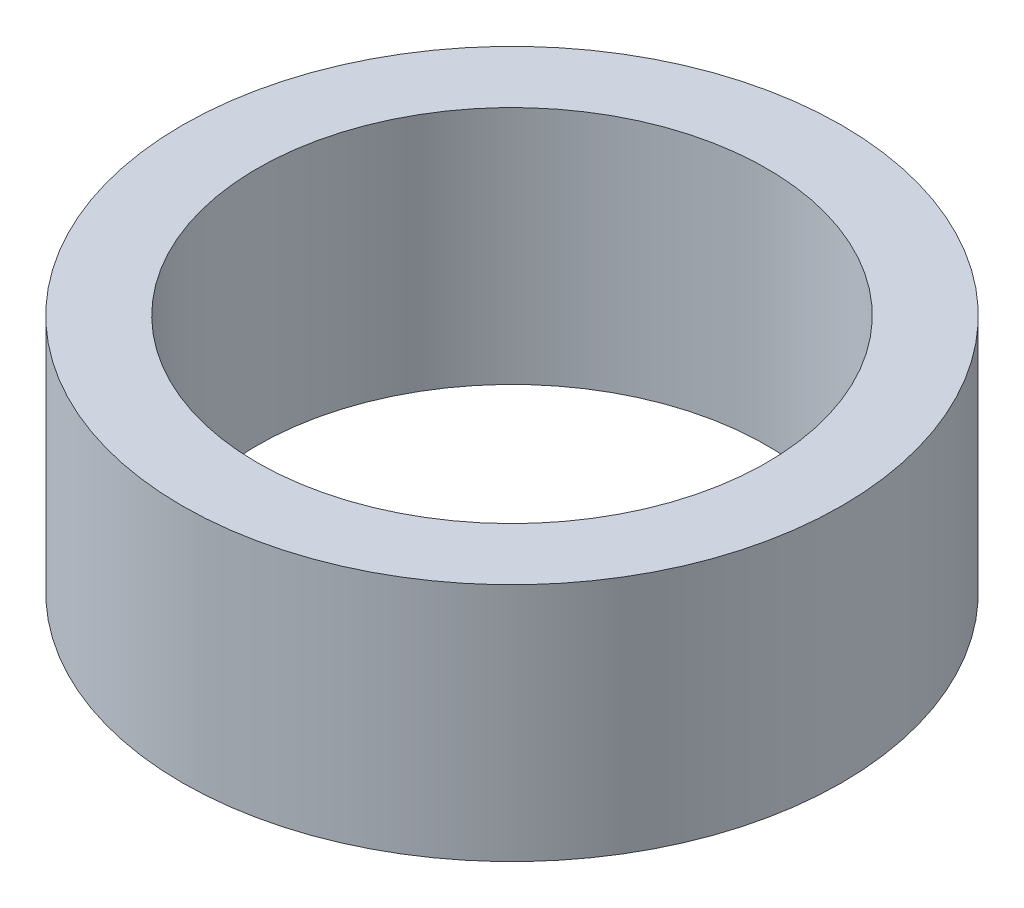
ISO-10303-21;
HEADER;
FILE_DESCRIPTION(('STEP AP214'),'2;1');
FILE_NAME('part.step','',(''),(''),'','','');
FILE_SCHEMA(('AUTOMOTIVE_DESIGN { 1 0 10303 214 1 1 1 1 }'));
ENDSEC;
DATA;
#1=APPLICATION_CONTEXT('core data for automotive mechanical design processes');
#2=APPLICATION_PROTOCOL_DEFINITION('international standard','automotive_design',2000,#1);
#3=PRODUCT_CONTEXT('',#1,'mechanical');
#4=PRODUCT('Part','Part','',(#3));
#5=PRODUCT_RELATED_PRODUCT_CATEGORY('part','',(#4));
#6=PRODUCT_DEFINITION_FORMATION('','',#4);
#7=PRODUCT_DEFINITION_CONTEXT('part definition',#1,'design');
#8=PRODUCT_DEFINITION('design','',#6,#7);
#9=PRODUCT_DEFINITION_SHAPE('','',#8);
#10=(LENGTH_UNIT() NAMED_UNIT(*) SI_UNIT(.MILLI.,.METRE.));
#11=(NAMED_UNIT(*) PLANE_ANGLE_UNIT() SI_UNIT($,.RADIAN.));
#12=(NAMED_UNIT(*) SI_UNIT($,.STERADIAN.) SOLID_ANGLE_UNIT());
#13=UNCERTAINTY_MEASURE_WITH_UNIT(LENGTH_MEASURE(1.E-05),#10,'distance_accuracy_value','');
#14=(GEOMETRIC_REPRESENTATION_CONTEXT(3) GLOBAL_UNCERTAINTY_ASSIGNED_CONTEXT((#13)) GLOBAL_UNIT_ASSIGNED_CONTEXT((#10,
#11,#12)) REPRESENTATION_CONTEXT('',''));
#15=CARTESIAN_POINT('',(0.,0.,0.));
#16=DIRECTION('',(0.,0.,1.));
#17=DIRECTION('',(1.,0.,0.));
#18=AXIS2_PLACEMENT_3D('',#15,#16,#17);
#19=CARTESIAN_POINT('',(0.,90.,0.));
#20=DIRECTION('',(0.,1.,0.));
#21=DIRECTION('',(0.,0.,1.));
#22=AXIS2_PLACEMENT_3D('',#19,#20,#21);
#23=CYLINDRICAL_SURFACE('',#22,8.50000000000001);
#24=CARTESIAN_POINT('',(0.,42.,0.));
#25=DIRECTION('',(0.,1.,0.));
#26=DIRECTION('',(0.,0.,1.));
#27=AXIS2_PLACEMENT_3D('',#24,#25,#26);
#28=CIRCLE('',#27,8.50000000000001);
#29=CARTESIAN_POINT('',(0.,42.,8.50000000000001));
#30=VERTEX_POINT('',#29);
#31=EDGE_CURVE('E10',#30,#30,#28,.T.);
#32=ORIENTED_EDGE('',*,*,#31,.F.);
#33=EDGE_LOOP('',(#32));
#34=FACE_BOUND('',#33,.T.);
#35=CARTESIAN_POINT('',(0.,50.,0.));
#36=DIRECTION('',(0.,1.,0.));
#37=DIRECTION('',(0.,0.,1.));
#38=AXIS2_PLACEMENT_3D('',#35,#36,#37);
#39=CIRCLE('',#38,8.50000000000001);
#40=CARTESIAN_POINT('',(0.,50.,8.50000000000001));
#41=VERTEX_POINT('',#40);
#42=EDGE_CURVE('E46',#41,#41,#39,.T.);
#43=ORIENTED_EDGE('',*,*,#42,.T.);
#44=EDGE_LOOP('',(#43));
#45=FACE_BOUND('',#44,.T.);
#46=ADVANCED_FACE('F32',(#34,#45),#23,.F.);
#47=CARTESIAN_POINT('',(8.50000000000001,42.,0.));
#48=DIRECTION('',(0.,1.,0.));
#49=DIRECTION('',(0.,0.,1.));
#50=AXIS2_PLACEMENT_3D('',#47,#48,#49);
#51=PLANE('',#50);
#52=CARTESIAN_POINT('',(0.,42.,0.));
#53=DIRECTION('',(0.,1.,0.));
#54=DIRECTION('',(0.,0.,1.));
#55=AXIS2_PLACEMENT_3D('',#52,#53,#54);
#56=CIRCLE('',#55,11.);
#57=CARTESIAN_POINT('',(0.,42.,11.));
#58=VERTEX_POINT('',#57);
#59=EDGE_CURVE('E38',#58,#58,#56,.T.);
#60=ORIENTED_EDGE('',*,*,#59,.F.);
#61=EDGE_LOOP('',(#60));
#62=FACE_BOUND('',#61,.T.);
#63=ORIENTED_EDGE('',*,*,#31,.T.);
#64=EDGE_LOOP('',(#63));
#65=FACE_BOUND('',#64,.T.);
#66=ADVANCED_FACE('F61',(#62,#65),#51,.F.);
#67=CARTESIAN_POINT('',(0.,90.,0.));
#68=DIRECTION('',(0.,1.,0.));
#69=DIRECTION('',(0.,0.,1.));
#70=AXIS2_PLACEMENT_3D('',#67,#68,#69);
#71=CYLINDRICAL_SURFACE('',#70,11.);
#72=CARTESIAN_POINT('',(0.,50.,0.));
#73=DIRECTION('',(0.,1.,0.));
#74=DIRECTION('',(0.,0.,1.));
#75=AXIS2_PLACEMENT_3D('',#72,#73,#74);
#76=CIRCLE('',#75,11.);
#77=CARTESIAN_POINT('',(0.,50.,11.));
#78=VERTEX_POINT('',#77);
#79=EDGE_CURVE('E42',#78,#78,#76,.T.);
#80=ORIENTED_EDGE('',*,*,#79,.F.);
#81=EDGE_LOOP('',(#80));
#82=FACE_BOUND('',#81,.T.);
#83=ORIENTED_EDGE('',*,*,#59,.T.);
#84=EDGE_LOOP('',(#83));
#85=FACE_BOUND('',#84,.T.);
#86=ADVANCED_FACE('F56',(#82,#85),#71,.T.);
#87=CARTESIAN_POINT('',(8.50000000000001,50.,0.));
#88=DIRECTION('',(0.,-1.,0.));
#89=DIRECTION('',(0.,0.,-1.));
#90=AXIS2_PLACEMENT_3D('',#87,#88,#89);
#91=PLANE('',#90);
#92=ORIENTED_EDGE('',*,*,#42,.F.);
#93=EDGE_LOOP('',(#92));
#94=FACE_BOUND('',#93,.T.);
#95=ORIENTED_EDGE('',*,*,#79,.T.);
#96=EDGE_LOOP('',(#95));
#97=FACE_BOUND('',#96,.T.);
#98=ADVANCED_FACE('F53',(#94,#97),#91,.F.);
#99=CLOSED_SHELL('',(#46,#66,#86,#98));
#100=MANIFOLD_SOLID_BREP('B2',#99);
#101=ADVANCED_BREP_SHAPE_REPRESENTATION('',(#18,#100),#14);
#102=SHAPE_DEFINITION_REPRESENTATION(#9,#101);
ENDSEC;
END-ISO-10303-21;
